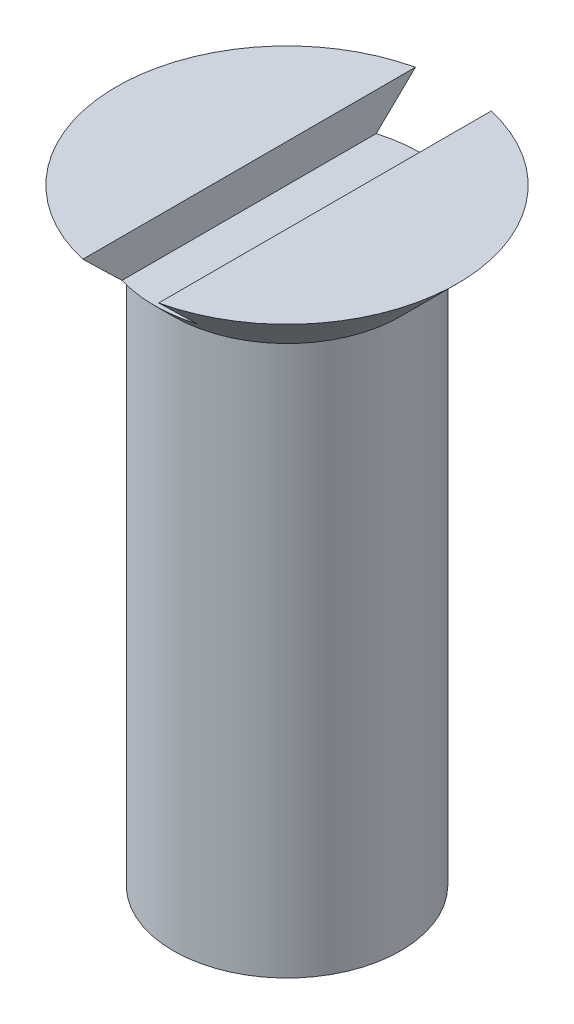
from build123d import *

# Parameters (mm, degrees)
SKETCH2_W          = 2
SKETCH2_H          = 10.509225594
CUT_EXTRUDE1_DEPTH = 1


with BuildPart() as part:
    # Sketch1 → Revolve1 (revolve)
    with BuildSketch(Plane.XY, mode=Mode.PRIVATE) as revolve1_sk:
        Polygon((0, 0), (3, 1.732050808), (3, 16.232050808), (4.5, 17.732050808), (0, 17.732050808), align=None)
    revolve(revolve1_sk.sketch.rotate(Axis((0, 0, 0), (0, -1, 0)), 90), axis=Axis((0, 0, 0), (0, -1, 0)))

    # Sketch2 → Cut-Extrude1 (cut)
    with BuildSketch(Plane(origin=(0, 17.732050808, 0), x_dir=(1, 0, 0), z_dir=(0, 1, 0))):
        Rectangle(SKETCH2_W, SKETCH2_H)
    extrude(amount=-CUT_EXTRUDE1_DEPTH, mode=Mode.SUBTRACT)


solid = part.part
